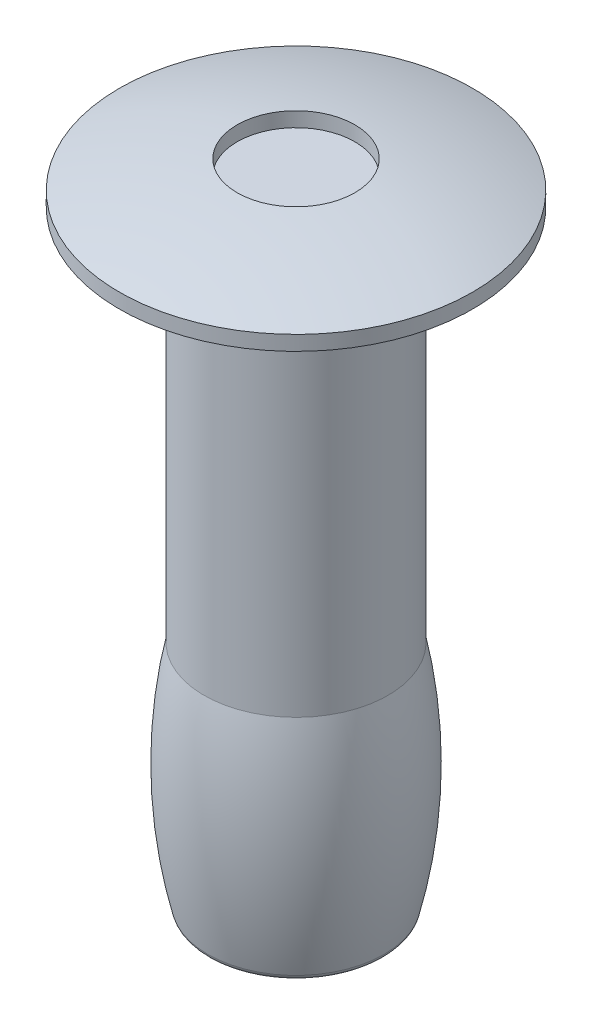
from build123d import *


with BuildPart() as part:
    # Sketch1 → Revolve1 (revolve)
    with BuildSketch(Plane.XY, mode=Mode.PRIVATE) as revolve1_sk:
        with BuildLine():
            Line((3.048, 5.708042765), (3.048, 5.454042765))
            Line((3.048, 5.454042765), (1.5875, 5.454042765))
            Line((1.5875, 5.454042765), (1.5875, -1.048357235))
            ThreePointArc((1.5875, -1.048357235), (1.770879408, -3.003841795), (1.520403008, -4.951868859))
            ThreePointArc((1.520403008, -4.951868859), (1.381886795, -5.047954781), (1.27, -4.921857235))
            Line((1.27, -4.921857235), (1.27, -4.159857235))
            ThreePointArc((1.27, -4.159857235), (0.724707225, -4.672211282), (0, -4.858357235))
            Line((0, -4.858357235), (0, 5.923829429))
            Line((0, 5.923829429), (1.016, 5.923829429))
            Line((1.016, 5.923829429), (1.016, 6.177829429))
            ThreePointArc((1.016, 6.177829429), (2.045531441, 6.001464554), (3.048, 5.708042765))
        make_face()
    revolve(revolve1_sk.sketch.rotate(Axis((0, 6.234844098, 0), (0, -1, 0)), 180), axis=Axis((0, 6.234844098, 0), (0, -1, 0)))


solid = part.part
